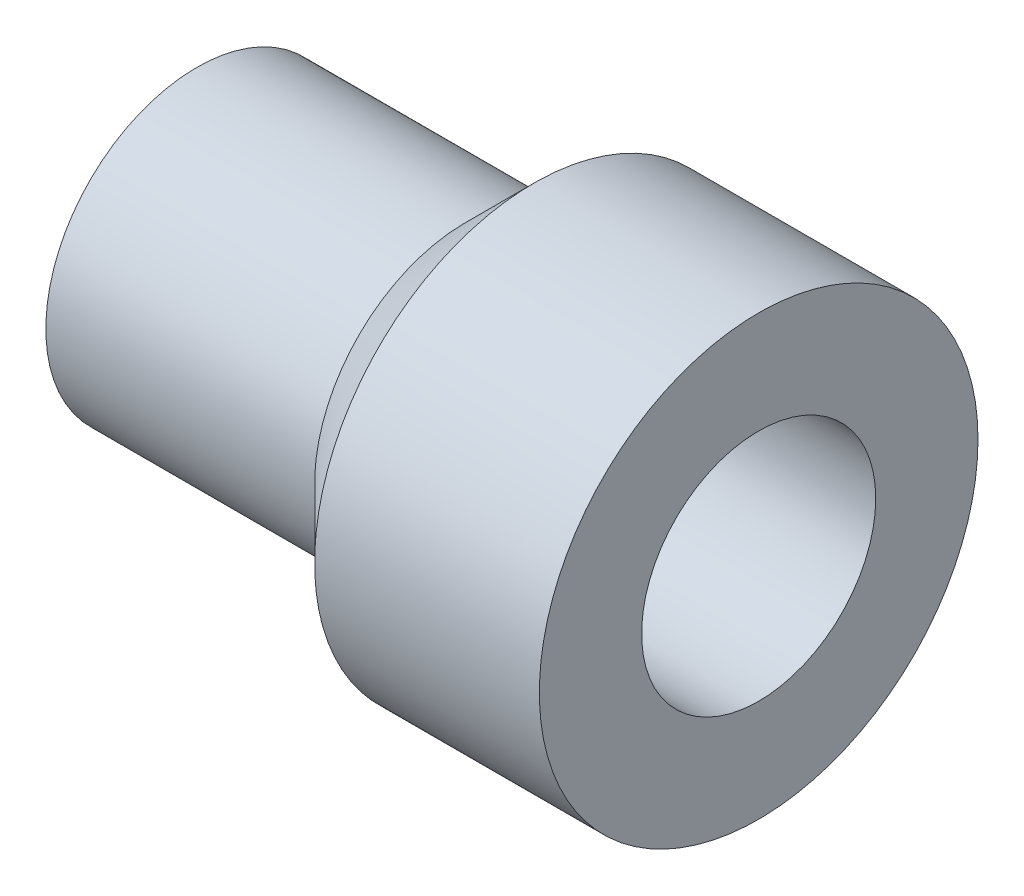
ISO-10303-21;
HEADER;
FILE_DESCRIPTION(('STEP AP214'),'2;1');
FILE_NAME('part.step','',(''),(''),'','','');
FILE_SCHEMA(('AUTOMOTIVE_DESIGN { 1 0 10303 214 1 1 1 1 }'));
ENDSEC;
DATA;
#1=APPLICATION_CONTEXT('core data for automotive mechanical design processes');
#2=APPLICATION_PROTOCOL_DEFINITION('international standard','automotive_design',2000,#1);
#3=PRODUCT_CONTEXT('',#1,'mechanical');
#4=PRODUCT('Part','Part','',(#3));
#5=PRODUCT_RELATED_PRODUCT_CATEGORY('part','',(#4));
#6=PRODUCT_DEFINITION_FORMATION('','',#4);
#7=PRODUCT_DEFINITION_CONTEXT('part definition',#1,'design');
#8=PRODUCT_DEFINITION('design','',#6,#7);
#9=PRODUCT_DEFINITION_SHAPE('','',#8);
#10=(LENGTH_UNIT() NAMED_UNIT(*) SI_UNIT(.MILLI.,.METRE.));
#11=(NAMED_UNIT(*) PLANE_ANGLE_UNIT() SI_UNIT($,.RADIAN.));
#12=(NAMED_UNIT(*) SI_UNIT($,.STERADIAN.) SOLID_ANGLE_UNIT());
#13=UNCERTAINTY_MEASURE_WITH_UNIT(LENGTH_MEASURE(1.E-05),#10,'distance_accuracy_value','');
#14=(GEOMETRIC_REPRESENTATION_CONTEXT(3) GLOBAL_UNCERTAINTY_ASSIGNED_CONTEXT((#13)) GLOBAL_UNIT_ASSIGNED_CONTEXT((#10,
#11,#12)) REPRESENTATION_CONTEXT('',''));
#15=CARTESIAN_POINT('',(0.,0.,0.));
#16=DIRECTION('',(0.,0.,1.));
#17=DIRECTION('',(1.,0.,0.));
#18=AXIS2_PLACEMENT_3D('',#15,#16,#17);
#19=CARTESIAN_POINT('',(15.,0.,0.));
#20=DIRECTION('',(-1.,0.,0.));
#21=DIRECTION('',(0.,0.,1.));
#22=AXIS2_PLACEMENT_3D('',#19,#20,#21);
#23=CYLINDRICAL_SURFACE('',#22,4.03);
#24=CARTESIAN_POINT('',(7.17500000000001,0.,0.));
#25=DIRECTION('',(1.,0.,0.));
#26=DIRECTION('',(0.,0.,-1.));
#27=AXIS2_PLACEMENT_3D('',#24,#25,#26);
#28=CIRCLE('',#27,4.03);
#29=CARTESIAN_POINT('',(7.17500000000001,0.,-4.03));
#30=VERTEX_POINT('',#29);
#31=EDGE_CURVE('E10',#30,#30,#28,.F.);
#32=ORIENTED_EDGE('',*,*,#31,.T.);
#33=EDGE_LOOP('',(#32));
#34=FACE_BOUND('',#33,.T.);
#35=CARTESIAN_POINT('',(0.,0.,0.));
#36=DIRECTION('',(1.,0.,0.));
#37=DIRECTION('',(0.,0.,-1.));
#38=AXIS2_PLACEMENT_3D('',#35,#36,#37);
#39=CIRCLE('',#38,4.03);
#40=CARTESIAN_POINT('',(0.,0.,-4.03));
#41=VERTEX_POINT('',#40);
#42=EDGE_CURVE('E42',#41,#41,#39,.T.);
#43=ORIENTED_EDGE('',*,*,#42,.T.);
#44=EDGE_LOOP('',(#43));
#45=FACE_BOUND('',#44,.T.);
#46=ADVANCED_FACE('F31',(#34,#45),#23,.T.);
#47=CARTESIAN_POINT('',(15.,0.,0.));
#48=DIRECTION('',(1.,0.,0.));
#49=DIRECTION('',(0.,0.,-1.));
#50=AXIS2_PLACEMENT_3D('',#47,#48,#49);
#51=PLANE('',#50);
#52=CARTESIAN_POINT('',(15.,0.,0.));
#53=DIRECTION('',(1.,0.,0.));
#54=DIRECTION('',(0.,0.,-1.));
#55=AXIS2_PLACEMENT_3D('',#52,#53,#54);
#56=CIRCLE('',#55,3.125);
#57=CARTESIAN_POINT('',(15.,0.,-3.125));
#58=VERTEX_POINT('',#57);
#59=EDGE_CURVE('E49',#58,#58,#56,.T.);
#60=ORIENTED_EDGE('',*,*,#59,.F.);
#61=EDGE_LOOP('',(#60));
#62=FACE_BOUND('',#61,.T.);
#63=CARTESIAN_POINT('',(15.,0.,0.));
#64=DIRECTION('',(1.,0.,0.));
#65=DIRECTION('',(0.,0.,-1.));
#66=AXIS2_PLACEMENT_3D('',#63,#64,#65);
#67=CIRCLE('',#66,5.855);
#68=CARTESIAN_POINT('',(15.,0.,-5.855));
#69=VERTEX_POINT('',#68);
#70=EDGE_CURVE('E52',#69,#69,#67,.T.);
#71=ORIENTED_EDGE('',*,*,#70,.T.);
#72=EDGE_LOOP('',(#71));
#73=FACE_BOUND('',#72,.T.);
#74=ADVANCED_FACE('F58',(#62,#73),#51,.T.);
#75=CARTESIAN_POINT('',(0.,0.,0.));
#76=DIRECTION('',(1.,0.,0.));
#77=DIRECTION('',(0.,0.,-1.));
#78=AXIS2_PLACEMENT_3D('',#75,#76,#77);
#79=PLANE('',#78);
#80=CARTESIAN_POINT('',(0.,0.,0.));
#81=DIRECTION('',(1.,0.,0.));
#82=DIRECTION('',(0.,0.,-1.));
#83=AXIS2_PLACEMENT_3D('',#80,#81,#82);
#84=CIRCLE('',#83,3.125);
#85=CARTESIAN_POINT('',(0.,0.,-3.125));
#86=VERTEX_POINT('',#85);
#87=EDGE_CURVE('E46',#86,#86,#84,.T.);
#88=ORIENTED_EDGE('',*,*,#87,.T.);
#89=EDGE_LOOP('',(#88));
#90=FACE_BOUND('',#89,.T.);
#91=ORIENTED_EDGE('',*,*,#42,.F.);
#92=EDGE_LOOP('',(#91));
#93=FACE_BOUND('',#92,.T.);
#94=ADVANCED_FACE('F69',(#90,#93),#79,.F.);
#95=CARTESIAN_POINT('',(0.,0.,0.));
#96=DIRECTION('',(1.,0.,0.));
#97=DIRECTION('',(0.,0.,-1.));
#98=AXIS2_PLACEMENT_3D('',#95,#96,#97);
#99=CYLINDRICAL_SURFACE('',#98,3.125);
#100=ORIENTED_EDGE('',*,*,#87,.F.);
#101=EDGE_LOOP('',(#100));
#102=FACE_BOUND('',#101,.T.);
#103=ORIENTED_EDGE('',*,*,#59,.T.);
#104=EDGE_LOOP('',(#103));
#105=FACE_BOUND('',#104,.T.);
#106=ADVANCED_FACE('F62',(#102,#105),#99,.F.);
#107=CARTESIAN_POINT('',(7.,0.,0.));
#108=DIRECTION('',(1.,0.,0.));
#109=DIRECTION('',(0.,0.,-1.));
#110=AXIS2_PLACEMENT_3D('',#107,#108,#109);
#111=CYLINDRICAL_SURFACE('',#110,5.855);
#112=CARTESIAN_POINT('',(9.00000000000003,0.,0.));
#113=DIRECTION('',(1.,0.,0.));
#114=DIRECTION('',(0.,0.,-1.));
#115=AXIS2_PLACEMENT_3D('',#112,#113,#114);
#116=CIRCLE('',#115,5.855);
#117=CARTESIAN_POINT('',(9.00000000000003,0.,-5.855));
#118=VERTEX_POINT('',#117);
#119=EDGE_CURVE('E38',#118,#118,#116,.T.);
#120=ORIENTED_EDGE('',*,*,#119,.T.);
#121=EDGE_LOOP('',(#120));
#122=FACE_BOUND('',#121,.T.);
#123=ORIENTED_EDGE('',*,*,#70,.F.);
#124=EDGE_LOOP('',(#123));
#125=FACE_BOUND('',#124,.T.);
#126=ADVANCED_FACE('F60',(#122,#125),#111,.T.);
#127=CARTESIAN_POINT('',(9.00000000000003,0.,0.));
#128=DIRECTION('',(1.,0.,0.));
#129=DIRECTION('',(0.,0.,-1.));
#130=AXIS2_PLACEMENT_3D('',#127,#128,#129);
#131=CONICAL_SURFACE('',#130,5.855,0.785398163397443);
#132=ORIENTED_EDGE('',*,*,#31,.F.);
#133=EDGE_LOOP('',(#132));
#134=FACE_BOUND('',#133,.T.);
#135=ORIENTED_EDGE('',*,*,#119,.F.);
#136=EDGE_LOOP('',(#135));
#137=FACE_BOUND('',#136,.T.);
#138=ADVANCED_FACE('F33',(#134,#137),#131,.T.);
#139=CLOSED_SHELL('',(#46,#74,#94,#106,#126,#138));
#140=MANIFOLD_SOLID_BREP('B2',#139);
#141=ADVANCED_BREP_SHAPE_REPRESENTATION('',(#18,#140),#14);
#142=SHAPE_DEFINITION_REPRESENTATION(#9,#141);
ENDSEC;
END-ISO-10303-21;
